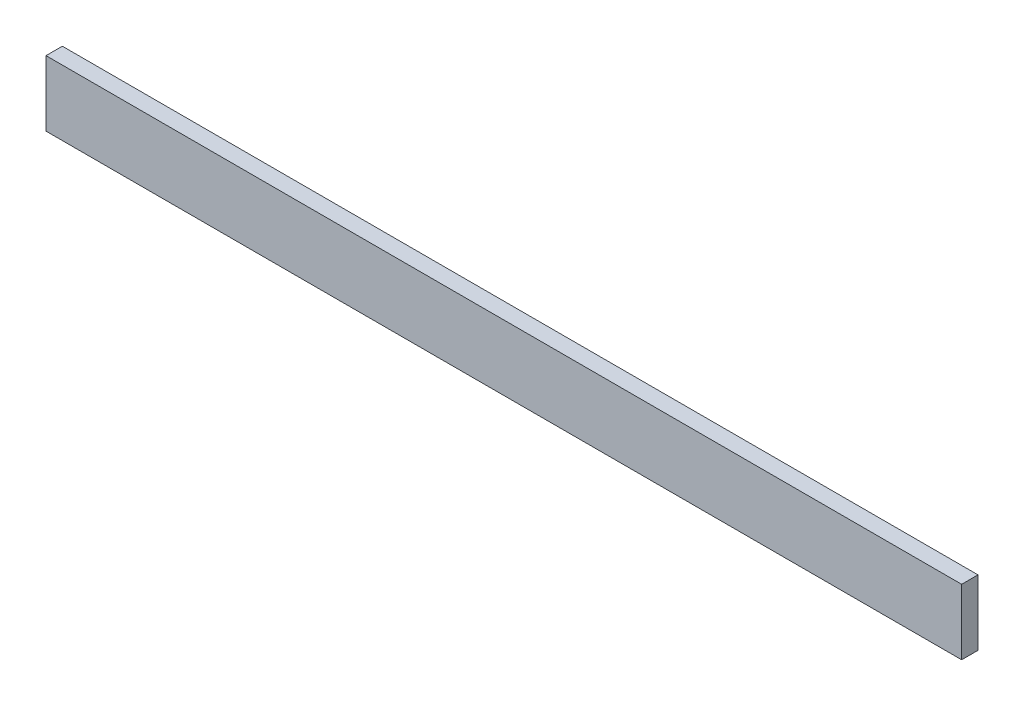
from build123d import *

# Parameters (mm, degrees)
SKETCH1_W      = 1066.8
SKETCH1_H      = 76.2
EXTRUDE1_DEPTH = 19.05


with BuildPart() as part:
    # Sketch1 → Extrude1 (new body)
    with BuildSketch(Plane.XY):
        with Locations((533.4, 38.1)):
            Rectangle(SKETCH1_W, SKETCH1_H)
    extrude(amount=EXTRUDE1_DEPTH)


solid = part.part
